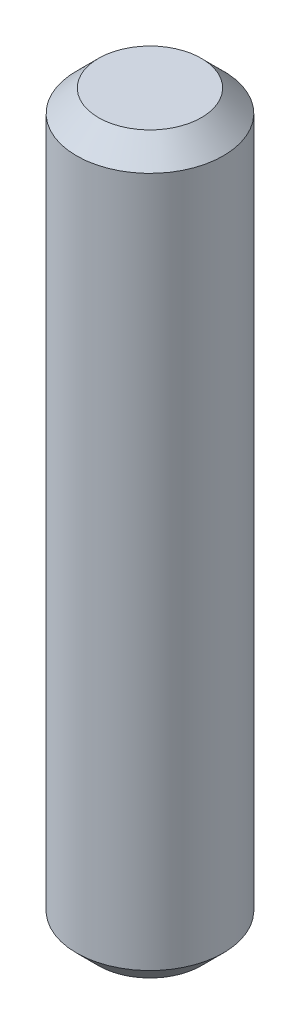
ISO-10303-21;
HEADER;
FILE_DESCRIPTION(('STEP AP214'),'2;1');
FILE_NAME('part.step','',(''),(''),'','','');
FILE_SCHEMA(('AUTOMOTIVE_DESIGN { 1 0 10303 214 1 1 1 1 }'));
ENDSEC;
DATA;
#1=APPLICATION_CONTEXT('core data for automotive mechanical design processes');
#2=APPLICATION_PROTOCOL_DEFINITION('international standard','automotive_design',2000,#1);
#3=PRODUCT_CONTEXT('',#1,'mechanical');
#4=PRODUCT('Part','Part','',(#3));
#5=PRODUCT_RELATED_PRODUCT_CATEGORY('part','',(#4));
#6=PRODUCT_DEFINITION_FORMATION('','',#4);
#7=PRODUCT_DEFINITION_CONTEXT('part definition',#1,'design');
#8=PRODUCT_DEFINITION('design','',#6,#7);
#9=PRODUCT_DEFINITION_SHAPE('','',#8);
#10=(LENGTH_UNIT() NAMED_UNIT(*) SI_UNIT(.MILLI.,.METRE.));
#11=(NAMED_UNIT(*) PLANE_ANGLE_UNIT() SI_UNIT($,.RADIAN.));
#12=(NAMED_UNIT(*) SI_UNIT($,.STERADIAN.) SOLID_ANGLE_UNIT());
#13=UNCERTAINTY_MEASURE_WITH_UNIT(LENGTH_MEASURE(1.E-05),#10,'distance_accuracy_value','');
#14=(GEOMETRIC_REPRESENTATION_CONTEXT(3) GLOBAL_UNCERTAINTY_ASSIGNED_CONTEXT((#13)) GLOBAL_UNIT_ASSIGNED_CONTEXT((#10,
#11,#12)) REPRESENTATION_CONTEXT('',''));
#15=CARTESIAN_POINT('',(0.,0.,0.));
#16=DIRECTION('',(0.,0.,1.));
#17=DIRECTION('',(1.,0.,0.));
#18=AXIS2_PLACEMENT_3D('',#15,#16,#17);
#19=CARTESIAN_POINT('',(0.,10.,0.));
#20=DIRECTION('',(0.,-1.,0.));
#21=DIRECTION('',(0.,0.,-1.));
#22=AXIS2_PLACEMENT_3D('',#19,#20,#21);
#23=CYLINDRICAL_SURFACE('',#22,1.);
#24=CARTESIAN_POINT('',(0.,0.3,0.));
#25=DIRECTION('',(0.,1.,0.));
#26=DIRECTION('',(0.,0.,1.));
#27=AXIS2_PLACEMENT_3D('',#24,#25,#26);
#28=CIRCLE('',#27,1.);
#29=CARTESIAN_POINT('',(0.,0.3,1.));
#30=VERTEX_POINT('',#29);
#31=EDGE_CURVE('E50',#30,#30,#28,.T.);
#32=ORIENTED_EDGE('',*,*,#31,.T.);
#33=EDGE_LOOP('',(#32));
#34=FACE_BOUND('',#33,.T.);
#35=CARTESIAN_POINT('',(0.,9.7,0.));
#36=DIRECTION('',(0.,1.,0.));
#37=DIRECTION('',(0.,0.,1.));
#38=AXIS2_PLACEMENT_3D('',#35,#36,#37);
#39=CIRCLE('',#38,1.);
#40=CARTESIAN_POINT('',(0.,9.7,1.));
#41=VERTEX_POINT('',#40);
#42=EDGE_CURVE('E54',#41,#41,#39,.F.);
#43=ORIENTED_EDGE('',*,*,#42,.T.);
#44=EDGE_LOOP('',(#43));
#45=FACE_BOUND('',#44,.T.);
#46=ADVANCED_FACE('F38',(#34,#45),#23,.T.);
#47=CARTESIAN_POINT('',(0.,10.,0.));
#48=DIRECTION('',(0.,1.,0.));
#49=DIRECTION('',(0.,0.,1.));
#50=AXIS2_PLACEMENT_3D('',#47,#48,#49);
#51=PLANE('',#50);
#52=CARTESIAN_POINT('',(0.,10.,0.));
#53=DIRECTION('',(0.,1.,0.));
#54=DIRECTION('',(0.,0.,1.));
#55=AXIS2_PLACEMENT_3D('',#52,#53,#54);
#56=CIRCLE('',#55,0.700000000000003);
#57=CARTESIAN_POINT('',(0.,10.,0.700000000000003));
#58=VERTEX_POINT('',#57);
#59=EDGE_CURVE('E10',#58,#58,#56,.T.);
#60=ORIENTED_EDGE('',*,*,#59,.T.);
#61=EDGE_LOOP('',(#60));
#62=FACE_BOUND('',#61,.T.);
#63=ADVANCED_FACE('F70',(#62),#51,.T.);
#64=CARTESIAN_POINT('',(0.,0.,0.));
#65=DIRECTION('',(0.,1.,0.));
#66=DIRECTION('',(0.,0.,1.));
#67=AXIS2_PLACEMENT_3D('',#64,#65,#66);
#68=PLANE('',#67);
#69=CARTESIAN_POINT('',(0.,0.,0.));
#70=DIRECTION('',(0.,1.,0.));
#71=DIRECTION('',(0.,0.,1.));
#72=AXIS2_PLACEMENT_3D('',#69,#70,#71);
#73=CIRCLE('',#72,0.7);
#74=CARTESIAN_POINT('',(0.,0.,0.7));
#75=VERTEX_POINT('',#74);
#76=EDGE_CURVE('E46',#75,#75,#73,.F.);
#77=ORIENTED_EDGE('',*,*,#76,.T.);
#78=EDGE_LOOP('',(#77));
#79=FACE_BOUND('',#78,.T.);
#80=ADVANCED_FACE('F67',(#79),#68,.F.);
#81=CARTESIAN_POINT('',(0.,0.3,0.));
#82=DIRECTION('',(0.,1.,0.));
#83=DIRECTION('',(0.,0.,1.));
#84=AXIS2_PLACEMENT_3D('',#81,#82,#83);
#85=CONICAL_SURFACE('',#84,1.,0.785398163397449);
#86=ORIENTED_EDGE('',*,*,#76,.F.);
#87=EDGE_LOOP('',(#86));
#88=FACE_BOUND('',#87,.T.);
#89=ORIENTED_EDGE('',*,*,#31,.F.);
#90=EDGE_LOOP('',(#89));
#91=FACE_BOUND('',#90,.T.);
#92=ADVANCED_FACE('F63',(#88,#91),#85,.T.);
#93=CARTESIAN_POINT('',(0.,10.,0.));
#94=DIRECTION('',(0.,-1.,0.));
#95=DIRECTION('',(0.,0.,-1.));
#96=AXIS2_PLACEMENT_3D('',#93,#94,#95);
#97=CONICAL_SURFACE('',#96,0.700000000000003,0.785398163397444);
#98=ORIENTED_EDGE('',*,*,#42,.F.);
#99=EDGE_LOOP('',(#98));
#100=FACE_BOUND('',#99,.T.);
#101=ORIENTED_EDGE('',*,*,#59,.F.);
#102=EDGE_LOOP('',(#101));
#103=FACE_BOUND('',#102,.T.);
#104=ADVANCED_FACE('F41',(#100,#103),#97,.T.);
#105=CLOSED_SHELL('',(#46,#63,#80,#92,#104));
#106=MANIFOLD_SOLID_BREP('B2',#105);
#107=ADVANCED_BREP_SHAPE_REPRESENTATION('',(#18,#106),#14);
#108=SHAPE_DEFINITION_REPRESENTATION(#9,#107);
ENDSEC;
END-ISO-10303-21;
